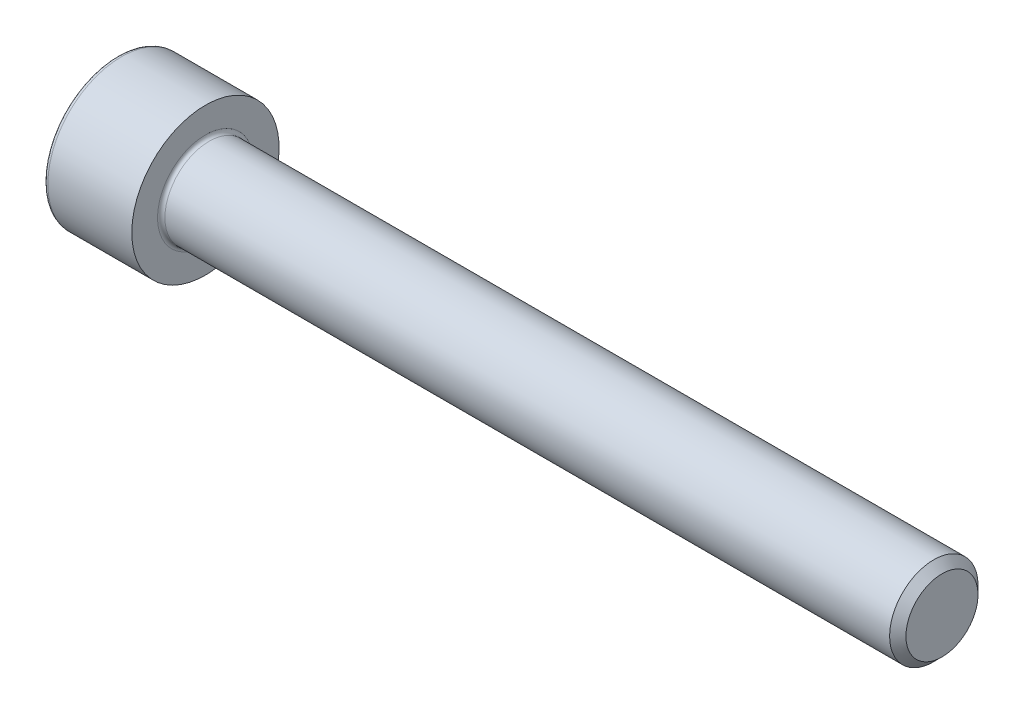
ISO-10303-21;
HEADER;
FILE_DESCRIPTION(('STEP AP214'),'2;1');
FILE_NAME('part.step','',(''),(''),'','','');
FILE_SCHEMA(('AUTOMOTIVE_DESIGN { 1 0 10303 214 1 1 1 1 }'));
ENDSEC;
DATA;
#1=APPLICATION_CONTEXT('core data for automotive mechanical design processes');
#2=APPLICATION_PROTOCOL_DEFINITION('international standard','automotive_design',2000,#1);
#3=PRODUCT_CONTEXT('',#1,'mechanical');
#4=PRODUCT('Part','Part','',(#3));
#5=PRODUCT_RELATED_PRODUCT_CATEGORY('part','',(#4));
#6=PRODUCT_DEFINITION_FORMATION('','',#4);
#7=PRODUCT_DEFINITION_CONTEXT('part definition',#1,'design');
#8=PRODUCT_DEFINITION('design','',#6,#7);
#9=PRODUCT_DEFINITION_SHAPE('','',#8);
#10=(LENGTH_UNIT() NAMED_UNIT(*) SI_UNIT(.MILLI.,.METRE.));
#11=(NAMED_UNIT(*) PLANE_ANGLE_UNIT() SI_UNIT($,.RADIAN.));
#12=(NAMED_UNIT(*) SI_UNIT($,.STERADIAN.) SOLID_ANGLE_UNIT());
#13=UNCERTAINTY_MEASURE_WITH_UNIT(LENGTH_MEASURE(1.E-05),#10,'distance_accuracy_value','');
#14=(GEOMETRIC_REPRESENTATION_CONTEXT(3) GLOBAL_UNCERTAINTY_ASSIGNED_CONTEXT((#13)) GLOBAL_UNIT_ASSIGNED_CONTEXT((#10,
#11,#12)) REPRESENTATION_CONTEXT('',''));
#15=CARTESIAN_POINT('',(0.,0.,0.));
#16=DIRECTION('',(0.,0.,1.));
#17=DIRECTION('',(1.,0.,0.));
#18=AXIS2_PLACEMENT_3D('',#15,#16,#17);
#19=CARTESIAN_POINT('',(0.,0.,0.));
#20=DIRECTION('',(-1.,0.,0.));
#21=DIRECTION('',(0.,0.,1.));
#22=AXIS2_PLACEMENT_3D('',#19,#20,#21);
#23=PLANE('',#22);
#24=DIRECTION('',(0.,-0.499999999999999,0.866025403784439));
#25=VECTOR('',#24,1.);
#26=CARTESIAN_POINT('',(0.,2.93524876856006,0.));
#27=LINE('',#26,#25);
#28=CARTESIAN_POINT('',(0.,2.93524876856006,0.));
#29=VERTEX_POINT('',#28);
#30=CARTESIAN_POINT('',(0.,1.46762438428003,2.542));
#31=VERTEX_POINT('',#30);
#32=EDGE_CURVE('E265',#29,#31,#27,.T.);
#33=ORIENTED_EDGE('',*,*,#32,.T.);
#34=DIRECTION('',(0.,1.,0.));
#35=VECTOR('',#34,1.);
#36=CARTESIAN_POINT('',(0.,-1.46762438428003,2.542));
#37=LINE('',#36,#35);
#38=CARTESIAN_POINT('',(0.,-1.46762438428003,2.542));
#39=VERTEX_POINT('',#38);
#40=EDGE_CURVE('E137',#39,#31,#37,.T.);
#41=ORIENTED_EDGE('',*,*,#40,.F.);
#42=DIRECTION('',(0.,-0.500000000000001,-0.866025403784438));
#43=VECTOR('',#42,1.);
#44=CARTESIAN_POINT('',(0.,-1.46762438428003,2.542));
#45=LINE('',#44,#43);
#46=CARTESIAN_POINT('',(0.,-2.93524876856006,0.));
#47=VERTEX_POINT('',#46);
#48=EDGE_CURVE('E268',#39,#47,#45,.T.);
#49=ORIENTED_EDGE('',*,*,#48,.T.);
#50=DIRECTION('',(0.,0.499999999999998,-0.86602540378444));
#51=VECTOR('',#50,1.);
#52=CARTESIAN_POINT('',(0.,-2.93524876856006,0.));
#53=LINE('',#52,#51);
#54=CARTESIAN_POINT('',(0.,-1.46762438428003,-2.542));
#55=VERTEX_POINT('',#54);
#56=EDGE_CURVE('E271',#47,#55,#53,.T.);
#57=ORIENTED_EDGE('',*,*,#56,.T.);
#58=DIRECTION('',(0.,-1.,0.));
#59=VECTOR('',#58,1.);
#60=CARTESIAN_POINT('',(0.,1.46762438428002,-2.542));
#61=LINE('',#60,#59);
#62=CARTESIAN_POINT('',(0.,1.46762438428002,-2.542));
#63=VERTEX_POINT('',#62);
#64=EDGE_CURVE('E274',#63,#55,#61,.T.);
#65=ORIENTED_EDGE('',*,*,#64,.F.);
#66=DIRECTION('',(0.,-0.500000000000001,-0.866025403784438));
#67=VECTOR('',#66,1.);
#68=CARTESIAN_POINT('',(0.,2.93524876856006,0.));
#69=LINE('',#68,#67);
#70=EDGE_CURVE('E132',#29,#63,#69,.T.);
#71=ORIENTED_EDGE('',*,*,#70,.F.);
#72=EDGE_LOOP('',(#33,#41,#49,#57,#65,#71));
#73=FACE_BOUND('',#72,.T.);
#74=CARTESIAN_POINT('',(0.,0.,0.));
#75=DIRECTION('',(-1.,0.,0.));
#76=DIRECTION('',(0.,0.,1.));
#77=AXIS2_PLACEMENT_3D('',#74,#75,#76);
#78=CIRCLE('',#77,4.7);
#79=CARTESIAN_POINT('',(0.,0.,4.7));
#80=VERTEX_POINT('',#79);
#81=EDGE_CURVE('E49',#80,#80,#78,.T.);
#82=ORIENTED_EDGE('',*,*,#81,.T.);
#83=EDGE_LOOP('',(#82));
#84=FACE_BOUND('',#83,.T.);
#85=ADVANCED_FACE('F41',(#73,#84),#23,.T.);
#86=CARTESIAN_POINT('',(-31.75,0.,0.));
#87=DIRECTION('',(-1.,0.,0.));
#88=DIRECTION('',(0.,0.,1.));
#89=AXIS2_PLACEMENT_3D('',#86,#87,#88);
#90=CYLINDRICAL_SURFACE('',#89,5.);
#91=CARTESIAN_POINT('',(0.300000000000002,0.,0.));
#92=DIRECTION('',(-1.,0.,0.));
#93=DIRECTION('',(0.,0.,1.));
#94=AXIS2_PLACEMENT_3D('',#91,#92,#93);
#95=CIRCLE('',#94,5.);
#96=CARTESIAN_POINT('',(0.300000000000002,0.,5.));
#97=VERTEX_POINT('',#96);
#98=EDGE_CURVE('E11',#97,#97,#95,.F.);
#99=ORIENTED_EDGE('',*,*,#98,.T.);
#100=EDGE_LOOP('',(#99));
#101=FACE_BOUND('',#100,.T.);
#102=CARTESIAN_POINT('',(6.,0.,0.));
#103=DIRECTION('',(-1.,0.,0.));
#104=DIRECTION('',(0.,0.,1.));
#105=AXIS2_PLACEMENT_3D('',#102,#103,#104);
#106=CIRCLE('',#105,5.);
#107=CARTESIAN_POINT('',(6.,0.,5.));
#108=VERTEX_POINT('',#107);
#109=EDGE_CURVE('E155',#108,#108,#106,.T.);
#110=ORIENTED_EDGE('',*,*,#109,.T.);
#111=EDGE_LOOP('',(#110));
#112=FACE_BOUND('',#111,.T.);
#113=ADVANCED_FACE('F180',(#101,#112),#90,.T.);
#114=CARTESIAN_POINT('',(6.,5.,0.));
#115=DIRECTION('',(1.,0.,0.));
#116=DIRECTION('',(0.,0.,-1.));
#117=AXIS2_PLACEMENT_3D('',#114,#115,#116);
#118=PLANE('',#117);
#119=CARTESIAN_POINT('',(6.,0.,0.));
#120=DIRECTION('',(1.,0.,0.));
#121=DIRECTION('',(0.,0.,-1.));
#122=AXIS2_PLACEMENT_3D('',#119,#120,#121);
#123=CIRCLE('',#122,3.25);
#124=CARTESIAN_POINT('',(6.,0.,-3.25));
#125=VERTEX_POINT('',#124);
#126=EDGE_CURVE('E158',#125,#125,#123,.F.);
#127=ORIENTED_EDGE('',*,*,#126,.T.);
#128=EDGE_LOOP('',(#127));
#129=FACE_BOUND('',#128,.T.);
#130=ORIENTED_EDGE('',*,*,#109,.F.);
#131=EDGE_LOOP('',(#130));
#132=FACE_BOUND('',#131,.T.);
#133=ADVANCED_FACE('F185',(#129,#132),#118,.T.);
#134=CARTESIAN_POINT('',(-31.75,0.,0.));
#135=DIRECTION('',(-1.,0.,0.));
#136=DIRECTION('',(0.,0.,1.));
#137=AXIS2_PLACEMENT_3D('',#134,#135,#136);
#138=CYLINDRICAL_SURFACE('',#137,3.);
#139=CARTESIAN_POINT('',(6.25,0.,0.));
#140=DIRECTION('',(1.,0.,0.));
#141=DIRECTION('',(0.,0.,-1.));
#142=AXIS2_PLACEMENT_3D('',#139,#140,#141);
#143=CIRCLE('',#142,3.);
#144=CARTESIAN_POINT('',(6.25,0.,-3.));
#145=VERTEX_POINT('',#144);
#146=EDGE_CURVE('E161',#145,#145,#143,.T.);
#147=ORIENTED_EDGE('',*,*,#146,.T.);
#148=EDGE_LOOP('',(#147));
#149=FACE_BOUND('',#148,.T.);
#150=CARTESIAN_POINT('',(55.4455,0.,0.));
#151=DIRECTION('',(-1.,0.,0.));
#152=DIRECTION('',(0.,0.,1.));
#153=AXIS2_PLACEMENT_3D('',#150,#151,#152);
#154=CIRCLE('',#153,3.);
#155=CARTESIAN_POINT('',(55.4455,0.,3.));
#156=VERTEX_POINT('',#155);
#157=EDGE_CURVE('E152',#156,#156,#154,.T.);
#158=ORIENTED_EDGE('',*,*,#157,.T.);
#159=EDGE_LOOP('',(#158));
#160=FACE_BOUND('',#159,.T.);
#161=ADVANCED_FACE('F191',(#149,#160),#138,.T.);
#162=CARTESIAN_POINT('',(56.,0.,0.));
#163=DIRECTION('',(-1.,0.,0.));
#164=DIRECTION('',(0.,0.,1.));
#165=AXIS2_PLACEMENT_3D('',#162,#163,#164);
#166=CONICAL_SURFACE('',#165,2.4455,0.785398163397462);
#167=ORIENTED_EDGE('',*,*,#157,.F.);
#168=EDGE_LOOP('',(#167));
#169=FACE_BOUND('',#168,.T.);
#170=CARTESIAN_POINT('',(56.,0.,0.));
#171=DIRECTION('',(-1.,0.,0.));
#172=DIRECTION('',(0.,0.,1.));
#173=AXIS2_PLACEMENT_3D('',#170,#171,#172);
#174=CIRCLE('',#173,2.4455);
#175=CARTESIAN_POINT('',(56.,0.,2.4455));
#176=VERTEX_POINT('',#175);
#177=EDGE_CURVE('E148',#176,#176,#174,.T.);
#178=ORIENTED_EDGE('',*,*,#177,.T.);
#179=EDGE_LOOP('',(#178));
#180=FACE_BOUND('',#179,.T.);
#181=ADVANCED_FACE('F195',(#169,#180),#166,.T.);
#182=CARTESIAN_POINT('',(56.,2.4455,0.));
#183=DIRECTION('',(1.,0.,0.));
#184=DIRECTION('',(0.,0.,-1.));
#185=AXIS2_PLACEMENT_3D('',#182,#183,#184);
#186=PLANE('',#185);
#187=ORIENTED_EDGE('',*,*,#177,.F.);
#188=EDGE_LOOP('',(#187));
#189=FACE_BOUND('',#188,.T.);
#190=ADVANCED_FACE('F177',(#189),#186,.T.);
#191=CARTESIAN_POINT('',(6.25,0.,0.));
#192=DIRECTION('',(1.,0.,0.));
#193=DIRECTION('',(0.,0.,-1.));
#194=AXIS2_PLACEMENT_3D('',#191,#192,#193);
#195=TOROIDAL_SURFACE('',#194,3.25,0.25);
#196=ORIENTED_EDGE('',*,*,#146,.F.);
#197=EDGE_LOOP('',(#196));
#198=FACE_BOUND('',#197,.T.);
#199=ORIENTED_EDGE('',*,*,#126,.F.);
#200=EDGE_LOOP('',(#199));
#201=FACE_BOUND('',#200,.T.);
#202=ADVANCED_FACE('F168',(#198,#201),#195,.F.);
#203=CARTESIAN_POINT('',(0.300000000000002,0.,0.));
#204=DIRECTION('',(-1.,0.,0.));
#205=DIRECTION('',(0.,0.,1.));
#206=AXIS2_PLACEMENT_3D('',#203,#204,#205);
#207=TOROIDAL_SURFACE('',#206,4.7,0.3);
#208=ORIENTED_EDGE('',*,*,#98,.F.);
#209=EDGE_LOOP('',(#208));
#210=FACE_BOUND('',#209,.T.);
#211=ORIENTED_EDGE('',*,*,#81,.F.);
#212=EDGE_LOOP('',(#211));
#213=FACE_BOUND('',#212,.T.);
#214=ADVANCED_FACE('F43',(#210,#213),#207,.T.);
#215=CARTESIAN_POINT('',(3.,2.93524876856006,0.));
#216=DIRECTION('',(0.,-0.866025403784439,-0.499999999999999));
#217=DIRECTION('',(0.,0.499999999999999,-0.866025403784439));
#218=AXIS2_PLACEMENT_3D('',#215,#216,#217);
#219=PLANE('',#218);
#220=ORIENTED_EDGE('',*,*,#32,.F.);
#221=DIRECTION('',(-1.,0.,0.));
#222=VECTOR('',#221,1.);
#223=CARTESIAN_POINT('',(3.,2.93524876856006,0.));
#224=LINE('',#223,#222);
#225=CARTESIAN_POINT('',(3.,2.93524876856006,0.));
#226=VERTEX_POINT('',#225);
#227=EDGE_CURVE('E255',#226,#29,#224,.T.);
#228=ORIENTED_EDGE('',*,*,#227,.F.);
#229=DIRECTION('',(0.,-0.499999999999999,0.866025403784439));
#230=VECTOR('',#229,1.);
#231=CARTESIAN_POINT('',(3.,2.93524876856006,0.));
#232=LINE('',#231,#230);
#233=CARTESIAN_POINT('',(3.,2.20143657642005,1.271));
#234=VERTEX_POINT('',#233);
#235=EDGE_CURVE('E124',#226,#234,#232,.T.);
#236=ORIENTED_EDGE('',*,*,#235,.T.);
#237=CARTESIAN_POINT('',(3.,1.46762438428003,2.542));
#238=VERTEX_POINT('',#237);
#239=EDGE_CURVE('E115',#234,#238,#232,.T.);
#240=ORIENTED_EDGE('',*,*,#239,.T.);
#241=DIRECTION('',(-1.,0.,0.));
#242=VECTOR('',#241,1.);
#243=CARTESIAN_POINT('',(3.,1.46762438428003,2.542));
#244=LINE('',#243,#242);
#245=EDGE_CURVE('E129',#238,#31,#244,.T.);
#246=ORIENTED_EDGE('',*,*,#245,.T.);
#247=EDGE_LOOP('',(#220,#228,#236,#240,#246));
#248=FACE_BOUND('',#247,.T.);
#249=ADVANCED_FACE('F128',(#248),#219,.T.);
#250=CARTESIAN_POINT('',(3.,-1.46762438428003,2.542));
#251=DIRECTION('',(0.,0.,1.));
#252=DIRECTION('',(0.,-1.,0.));
#253=AXIS2_PLACEMENT_3D('',#250,#251,#252);
#254=PLANE('',#253);
#255=ORIENTED_EDGE('',*,*,#40,.T.);
#256=ORIENTED_EDGE('',*,*,#245,.F.);
#257=DIRECTION('',(0.,1.,0.));
#258=VECTOR('',#257,1.);
#259=CARTESIAN_POINT('',(3.,-1.46762438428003,2.542));
#260=LINE('',#259,#258);
#261=CARTESIAN_POINT('',(3.,0.,2.542));
#262=VERTEX_POINT('',#261);
#263=EDGE_CURVE('E112',#262,#238,#260,.T.);
#264=ORIENTED_EDGE('',*,*,#263,.F.);
#265=CARTESIAN_POINT('',(3.,-1.46762438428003,2.542));
#266=VERTEX_POINT('',#265);
#267=EDGE_CURVE('E123',#266,#262,#260,.T.);
#268=ORIENTED_EDGE('',*,*,#267,.F.);
#269=DIRECTION('',(-1.,0.,0.));
#270=VECTOR('',#269,1.);
#271=CARTESIAN_POINT('',(3.,-1.46762438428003,2.542));
#272=LINE('',#271,#270);
#273=EDGE_CURVE('E139',#266,#39,#272,.T.);
#274=ORIENTED_EDGE('',*,*,#273,.T.);
#275=EDGE_LOOP('',(#255,#256,#264,#268,#274));
#276=FACE_BOUND('',#275,.T.);
#277=ADVANCED_FACE('F134',(#276),#254,.F.);
#278=CARTESIAN_POINT('',(3.,-1.46762438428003,2.542));
#279=DIRECTION('',(0.,0.866025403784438,-0.500000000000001));
#280=DIRECTION('',(0.,0.500000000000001,0.866025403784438));
#281=AXIS2_PLACEMENT_3D('',#278,#279,#280);
#282=PLANE('',#281);
#283=ORIENTED_EDGE('',*,*,#48,.F.);
#284=ORIENTED_EDGE('',*,*,#273,.F.);
#285=DIRECTION('',(0.,-0.500000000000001,-0.866025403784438));
#286=VECTOR('',#285,1.);
#287=CARTESIAN_POINT('',(3.,-1.46762438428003,2.542));
#288=LINE('',#287,#286);
#289=CARTESIAN_POINT('',(3.,-2.20143657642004,1.271));
#290=VERTEX_POINT('',#289);
#291=EDGE_CURVE('E294',#266,#290,#288,.T.);
#292=ORIENTED_EDGE('',*,*,#291,.T.);
#293=CARTESIAN_POINT('',(3.,-2.93524876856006,0.));
#294=VERTEX_POINT('',#293);
#295=EDGE_CURVE('E283',#290,#294,#288,.T.);
#296=ORIENTED_EDGE('',*,*,#295,.T.);
#297=DIRECTION('',(-1.,0.,0.));
#298=VECTOR('',#297,1.);
#299=CARTESIAN_POINT('',(3.,-2.93524876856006,0.));
#300=LINE('',#299,#298);
#301=EDGE_CURVE('E144',#294,#47,#300,.T.);
#302=ORIENTED_EDGE('',*,*,#301,.T.);
#303=EDGE_LOOP('',(#283,#284,#292,#296,#302));
#304=FACE_BOUND('',#303,.T.);
#305=ADVANCED_FACE('F209',(#304),#282,.T.);
#306=CARTESIAN_POINT('',(3.,-2.93524876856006,0.));
#307=DIRECTION('',(0.,0.86602540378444,0.499999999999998));
#308=DIRECTION('',(0.,-0.499999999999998,0.86602540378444));
#309=AXIS2_PLACEMENT_3D('',#306,#307,#308);
#310=PLANE('',#309);
#311=ORIENTED_EDGE('',*,*,#56,.F.);
#312=ORIENTED_EDGE('',*,*,#301,.F.);
#313=DIRECTION('',(0.,0.499999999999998,-0.86602540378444));
#314=VECTOR('',#313,1.);
#315=CARTESIAN_POINT('',(3.,-2.93524876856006,0.));
#316=LINE('',#315,#314);
#317=CARTESIAN_POINT('',(3.,-2.20143657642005,-1.271));
#318=VERTEX_POINT('',#317);
#319=EDGE_CURVE('E261',#294,#318,#316,.T.);
#320=ORIENTED_EDGE('',*,*,#319,.T.);
#321=CARTESIAN_POINT('',(3.,-1.46762438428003,-2.542));
#322=VERTEX_POINT('',#321);
#323=EDGE_CURVE('E293',#318,#322,#316,.T.);
#324=ORIENTED_EDGE('',*,*,#323,.T.);
#325=DIRECTION('',(-1.,0.,0.));
#326=VECTOR('',#325,1.);
#327=CARTESIAN_POINT('',(3.,-1.46762438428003,-2.542));
#328=LINE('',#327,#326);
#329=EDGE_CURVE('E254',#322,#55,#328,.T.);
#330=ORIENTED_EDGE('',*,*,#329,.T.);
#331=EDGE_LOOP('',(#311,#312,#320,#324,#330));
#332=FACE_BOUND('',#331,.T.);
#333=ADVANCED_FACE('F212',(#332),#310,.T.);
#334=CARTESIAN_POINT('',(3.,1.46762438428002,-2.542));
#335=DIRECTION('',(0.,0.,-1.));
#336=DIRECTION('',(0.,1.,0.));
#337=AXIS2_PLACEMENT_3D('',#334,#335,#336);
#338=PLANE('',#337);
#339=ORIENTED_EDGE('',*,*,#64,.T.);
#340=ORIENTED_EDGE('',*,*,#329,.F.);
#341=DIRECTION('',(0.,-1.,0.));
#342=VECTOR('',#341,1.);
#343=CARTESIAN_POINT('',(3.,1.46762438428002,-2.542));
#344=LINE('',#343,#342);
#345=CARTESIAN_POINT('',(3.,0.,-2.542));
#346=VERTEX_POINT('',#345);
#347=EDGE_CURVE('E258',#346,#322,#344,.T.);
#348=ORIENTED_EDGE('',*,*,#347,.F.);
#349=CARTESIAN_POINT('',(3.,1.46762438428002,-2.542));
#350=VERTEX_POINT('',#349);
#351=EDGE_CURVE('E56',#350,#346,#344,.T.);
#352=ORIENTED_EDGE('',*,*,#351,.F.);
#353=DIRECTION('',(-1.,0.,0.));
#354=VECTOR('',#353,1.);
#355=CARTESIAN_POINT('',(3.,1.46762438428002,-2.542));
#356=LINE('',#355,#354);
#357=EDGE_CURVE('E251',#350,#63,#356,.T.);
#358=ORIENTED_EDGE('',*,*,#357,.T.);
#359=EDGE_LOOP('',(#339,#340,#348,#352,#358));
#360=FACE_BOUND('',#359,.T.);
#361=ADVANCED_FACE('F216',(#360),#338,.F.);
#362=CARTESIAN_POINT('',(3.,2.93524876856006,0.));
#363=DIRECTION('',(0.,0.866025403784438,-0.500000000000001));
#364=DIRECTION('',(0.,0.500000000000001,0.866025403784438));
#365=AXIS2_PLACEMENT_3D('',#362,#363,#364);
#366=PLANE('',#365);
#367=ORIENTED_EDGE('',*,*,#70,.T.);
#368=ORIENTED_EDGE('',*,*,#357,.F.);
#369=DIRECTION('',(0.,-0.500000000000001,-0.866025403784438));
#370=VECTOR('',#369,1.);
#371=CARTESIAN_POINT('',(3.,2.93524876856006,0.));
#372=LINE('',#371,#370);
#373=CARTESIAN_POINT('',(3.,2.20143657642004,-1.271));
#374=VERTEX_POINT('',#373);
#375=EDGE_CURVE('E241',#374,#350,#372,.T.);
#376=ORIENTED_EDGE('',*,*,#375,.F.);
#377=EDGE_CURVE('E247',#226,#374,#372,.T.);
#378=ORIENTED_EDGE('',*,*,#377,.F.);
#379=ORIENTED_EDGE('',*,*,#227,.T.);
#380=EDGE_LOOP('',(#367,#368,#376,#378,#379));
#381=FACE_BOUND('',#380,.T.);
#382=ADVANCED_FACE('F220',(#381),#366,.F.);
#383=CARTESIAN_POINT('',(3.,4.40287315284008,-2.542));
#384=DIRECTION('',(1.,0.,0.));
#385=DIRECTION('',(0.,0.,-1.));
#386=AXIS2_PLACEMENT_3D('',#383,#384,#385);
#387=PLANE('',#386);
#388=ORIENTED_EDGE('',*,*,#347,.T.);
#389=ORIENTED_EDGE('',*,*,#323,.F.);
#390=CARTESIAN_POINT('',(3.,0.,0.));
#391=DIRECTION('',(-1.,0.,0.));
#392=DIRECTION('',(0.,0.,1.));
#393=AXIS2_PLACEMENT_3D('',#390,#391,#392);
#394=CIRCLE('',#393,2.542);
#395=EDGE_CURVE('E289',#346,#318,#394,.T.);
#396=ORIENTED_EDGE('',*,*,#395,.F.);
#397=EDGE_LOOP('',(#388,#389,#396));
#398=FACE_BOUND('',#397,.T.);
#399=ADVANCED_FACE('F224',(#398),#387,.F.);
#400=ORIENTED_EDGE('',*,*,#319,.F.);
#401=ORIENTED_EDGE('',*,*,#295,.F.);
#402=EDGE_CURVE('E142',#318,#290,#394,.T.);
#403=ORIENTED_EDGE('',*,*,#402,.F.);
#404=EDGE_LOOP('',(#400,#401,#403));
#405=FACE_BOUND('',#404,.T.);
#406=ADVANCED_FACE('F227',(#405),#387,.F.);
#407=ORIENTED_EDGE('',*,*,#291,.F.);
#408=ORIENTED_EDGE('',*,*,#267,.T.);
#409=EDGE_CURVE('E138',#290,#262,#394,.T.);
#410=ORIENTED_EDGE('',*,*,#409,.F.);
#411=EDGE_LOOP('',(#407,#408,#410));
#412=FACE_BOUND('',#411,.T.);
#413=ADVANCED_FACE('F232',(#412),#387,.F.);
#414=ORIENTED_EDGE('',*,*,#263,.T.);
#415=ORIENTED_EDGE('',*,*,#239,.F.);
#416=EDGE_CURVE('E118',#262,#234,#394,.T.);
#417=ORIENTED_EDGE('',*,*,#416,.F.);
#418=EDGE_LOOP('',(#414,#415,#417));
#419=FACE_BOUND('',#418,.T.);
#420=ADVANCED_FACE('F114',(#419),#387,.F.);
#421=ORIENTED_EDGE('',*,*,#235,.F.);
#422=ORIENTED_EDGE('',*,*,#377,.T.);
#423=EDGE_CURVE('E149',#234,#374,#394,.T.);
#424=ORIENTED_EDGE('',*,*,#423,.F.);
#425=EDGE_LOOP('',(#421,#422,#424));
#426=FACE_BOUND('',#425,.T.);
#427=ADVANCED_FACE('F235',(#426),#387,.F.);
#428=ORIENTED_EDGE('',*,*,#375,.T.);
#429=ORIENTED_EDGE('',*,*,#351,.T.);
#430=EDGE_CURVE('E244',#374,#346,#394,.T.);
#431=ORIENTED_EDGE('',*,*,#430,.F.);
#432=EDGE_LOOP('',(#428,#429,#431));
#433=FACE_BOUND('',#432,.T.);
#434=ADVANCED_FACE('F205',(#433),#387,.F.);
#435=CARTESIAN_POINT('',(3.,0.,0.));
#436=DIRECTION('',(-1.,0.,0.));
#437=DIRECTION('',(0.,0.,1.));
#438=AXIS2_PLACEMENT_3D('',#435,#436,#437);
#439=CONICAL_SURFACE('',#438,2.542,1.04719755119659);
#440=CARTESIAN_POINT('',(4.46762438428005,0.,0.));
#441=VERTEX_POINT('',#440);
#442=VERTEX_LOOP('',#441);
#443=FACE_BOUND('',#442,.T.);
#444=ORIENTED_EDGE('',*,*,#416,.T.);
#445=ORIENTED_EDGE('',*,*,#423,.T.);
#446=ORIENTED_EDGE('',*,*,#430,.T.);
#447=ORIENTED_EDGE('',*,*,#395,.T.);
#448=ORIENTED_EDGE('',*,*,#402,.T.);
#449=ORIENTED_EDGE('',*,*,#409,.T.);
#450=EDGE_LOOP('',(#444,#445,#446,#447,#448,#449));
#451=FACE_BOUND('',#450,.T.);
#452=ADVANCED_FACE('F203',(#443,#451),#439,.F.);
#453=CLOSED_SHELL('',(#85,#113,#133,#161,#181,#190,#202,#214,#249,#277,#305,#333,#361,#382,#399,
#406,#413,#420,#427,#434,#452));
#454=MANIFOLD_SOLID_BREP('B2',#453);
#455=ADVANCED_BREP_SHAPE_REPRESENTATION('',(#18,#454),#14);
#456=SHAPE_DEFINITION_REPRESENTATION(#9,#455);
ENDSEC;
END-ISO-10303-21;
